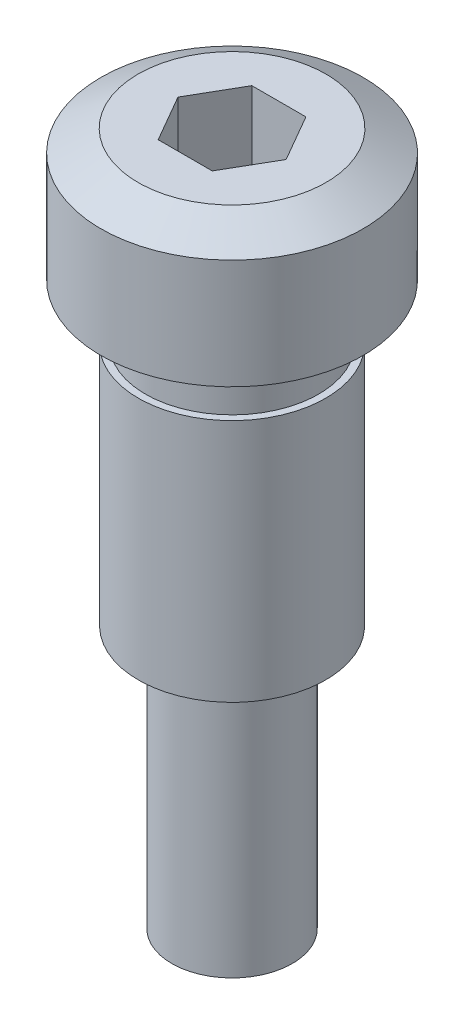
ISO-10303-21;
HEADER;
FILE_DESCRIPTION(('STEP AP214'),'2;1');
FILE_NAME('part.step','',(''),(''),'','','');
FILE_SCHEMA(('AUTOMOTIVE_DESIGN { 1 0 10303 214 1 1 1 1 }'));
ENDSEC;
DATA;
#1=APPLICATION_CONTEXT('core data for automotive mechanical design processes');
#2=APPLICATION_PROTOCOL_DEFINITION('international standard','automotive_design',2000,#1);
#3=PRODUCT_CONTEXT('',#1,'mechanical');
#4=PRODUCT('Part','Part','',(#3));
#5=PRODUCT_RELATED_PRODUCT_CATEGORY('part','',(#4));
#6=PRODUCT_DEFINITION_FORMATION('','',#4);
#7=PRODUCT_DEFINITION_CONTEXT('part definition',#1,'design');
#8=PRODUCT_DEFINITION('design','',#6,#7);
#9=PRODUCT_DEFINITION_SHAPE('','',#8);
#10=(LENGTH_UNIT() NAMED_UNIT(*) SI_UNIT(.MILLI.,.METRE.));
#11=(NAMED_UNIT(*) PLANE_ANGLE_UNIT() SI_UNIT($,.RADIAN.));
#12=(NAMED_UNIT(*) SI_UNIT($,.STERADIAN.) SOLID_ANGLE_UNIT());
#13=UNCERTAINTY_MEASURE_WITH_UNIT(LENGTH_MEASURE(1.E-05),#10,'distance_accuracy_value','');
#14=(GEOMETRIC_REPRESENTATION_CONTEXT(3) GLOBAL_UNCERTAINTY_ASSIGNED_CONTEXT((#13)) GLOBAL_UNIT_ASSIGNED_CONTEXT((#10,
#11,#12)) REPRESENTATION_CONTEXT('',''));
#15=CARTESIAN_POINT('',(0.,0.,0.));
#16=DIRECTION('',(0.,0.,1.));
#17=DIRECTION('',(1.,0.,0.));
#18=AXIS2_PLACEMENT_3D('',#15,#16,#17);
#19=CARTESIAN_POINT('',(0.,5.55752,0.));
#20=DIRECTION('',(0.,1.,0.));
#21=DIRECTION('',(-1.,0.,0.));
#22=AXIS2_PLACEMENT_3D('',#19,#20,#21);
#23=PLANE('',#22);
#24=CARTESIAN_POINT('',(0.,5.55752,0.));
#25=DIRECTION('',(0.,1.,0.));
#26=DIRECTION('',(-1.,0.,0.));
#27=AXIS2_PLACEMENT_3D('',#24,#25,#26);
#28=CIRCLE('',#27,3.98126155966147);
#29=CARTESIAN_POINT('',(-3.98126155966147,5.55752,0.));
#30=VERTEX_POINT('',#29);
#31=EDGE_CURVE('E175',#30,#30,#28,.T.);
#32=ORIENTED_EDGE('',*,*,#31,.T.);
#33=EDGE_LOOP('',(#32));
#34=FACE_BOUND('',#33,.T.);
#35=DIRECTION('',(-0.500000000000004,0.,-0.866025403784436));
#36=VECTOR('',#35,1.);
#37=CARTESIAN_POINT('',(2.29062564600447,5.55752,0.));
#38=LINE('',#37,#36);
#39=CARTESIAN_POINT('',(2.29062564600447,5.55752,0.));
#40=VERTEX_POINT('',#39);
#41=CARTESIAN_POINT('',(1.14531282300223,5.55752,-1.98374));
#42=VERTEX_POINT('',#41);
#43=EDGE_CURVE('E159',#40,#42,#38,.T.);
#44=ORIENTED_EDGE('',*,*,#43,.F.);
#45=DIRECTION('',(-0.500000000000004,0.,0.866025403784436));
#46=VECTOR('',#45,1.);
#47=CARTESIAN_POINT('',(2.29062564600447,5.55752,0.));
#48=LINE('',#47,#46);
#49=CARTESIAN_POINT('',(1.14531282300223,5.55752,1.98374));
#50=VERTEX_POINT('',#49);
#51=EDGE_CURVE('E61',#40,#50,#48,.T.);
#52=ORIENTED_EDGE('',*,*,#51,.T.);
#53=DIRECTION('',(-1.,0.,0.));
#54=VECTOR('',#53,1.);
#55=CARTESIAN_POINT('',(1.14531282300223,5.55752,1.98374));
#56=LINE('',#55,#54);
#57=CARTESIAN_POINT('',(-1.14531282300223,5.55752,1.98374));
#58=VERTEX_POINT('',#57);
#59=EDGE_CURVE('E146',#50,#58,#56,.T.);
#60=ORIENTED_EDGE('',*,*,#59,.T.);
#61=DIRECTION('',(-0.500000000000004,0.,-0.866025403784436));
#62=VECTOR('',#61,1.);
#63=CARTESIAN_POINT('',(-1.14531282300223,5.55752,1.98374));
#64=LINE('',#63,#62);
#65=CARTESIAN_POINT('',(-2.29062564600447,5.55752,0.));
#66=VERTEX_POINT('',#65);
#67=EDGE_CURVE('E150',#58,#66,#64,.T.);
#68=ORIENTED_EDGE('',*,*,#67,.T.);
#69=DIRECTION('',(-0.500000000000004,0.,0.866025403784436));
#70=VECTOR('',#69,1.);
#71=CARTESIAN_POINT('',(-1.14531282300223,5.55752,-1.98374));
#72=LINE('',#71,#70);
#73=CARTESIAN_POINT('',(-1.14531282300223,5.55752,-1.98374));
#74=VERTEX_POINT('',#73);
#75=EDGE_CURVE('E154',#74,#66,#72,.T.);
#76=ORIENTED_EDGE('',*,*,#75,.F.);
#77=DIRECTION('',(-1.,0.,0.));
#78=VECTOR('',#77,1.);
#79=CARTESIAN_POINT('',(1.14531282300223,5.55752,-1.98374));
#80=LINE('',#79,#78);
#81=EDGE_CURVE('E120',#42,#74,#80,.T.);
#82=ORIENTED_EDGE('',*,*,#81,.F.);
#83=EDGE_LOOP('',(#44,#52,#60,#68,#76,#82));
#84=FACE_BOUND('',#83,.T.);
#85=ADVANCED_FACE('F42',(#34,#84),#23,.T.);
#86=CARTESIAN_POINT('',(0.,-23.8125,0.));
#87=DIRECTION('',(0.,1.,0.));
#88=DIRECTION('',(-1.,0.,0.));
#89=AXIS2_PLACEMENT_3D('',#86,#87,#88);
#90=PLANE('',#89);
#91=CARTESIAN_POINT('',(0.,-23.8125,0.));
#92=DIRECTION('',(0.,1.,0.));
#93=DIRECTION('',(-1.,0.,0.));
#94=AXIS2_PLACEMENT_3D('',#91,#92,#93);
#95=CIRCLE('',#94,2.5527);
#96=CARTESIAN_POINT('',(-2.5527,-23.8125,0.));
#97=VERTEX_POINT('',#96);
#98=EDGE_CURVE('E11',#97,#97,#95,.T.);
#99=ORIENTED_EDGE('',*,*,#98,.F.);
#100=EDGE_LOOP('',(#99));
#101=FACE_BOUND('',#100,.T.);
#102=ADVANCED_FACE('F44',(#101),#90,.F.);
#103=CARTESIAN_POINT('',(0.,5.55752,0.));
#104=DIRECTION('',(0.,1.,0.));
#105=DIRECTION('',(-1.,0.,0.));
#106=AXIS2_PLACEMENT_3D('',#103,#104,#105);
#107=CYLINDRICAL_SURFACE('',#106,2.5527);
#108=ORIENTED_EDGE('',*,*,#98,.T.);
#109=EDGE_LOOP('',(#108));
#110=FACE_BOUND('',#109,.T.);
#111=CARTESIAN_POINT('',(0.,-12.7,0.));
#112=DIRECTION('',(0.,1.,0.));
#113=DIRECTION('',(-1.,0.,0.));
#114=AXIS2_PLACEMENT_3D('',#111,#112,#113);
#115=CIRCLE('',#114,2.5527);
#116=CARTESIAN_POINT('',(-2.5527,-12.7,0.));
#117=VERTEX_POINT('',#116);
#118=EDGE_CURVE('E51',#117,#117,#115,.T.);
#119=ORIENTED_EDGE('',*,*,#118,.F.);
#120=EDGE_LOOP('',(#119));
#121=FACE_BOUND('',#120,.T.);
#122=ADVANCED_FACE('F209',(#110,#121),#107,.T.);
#123=CARTESIAN_POINT('',(3.96875,-12.7,0.));
#124=DIRECTION('',(0.,-1.,0.));
#125=DIRECTION('',(1.,0.,0.));
#126=AXIS2_PLACEMENT_3D('',#123,#124,#125);
#127=PLANE('',#126);
#128=ORIENTED_EDGE('',*,*,#118,.T.);
#129=EDGE_LOOP('',(#128));
#130=FACE_BOUND('',#129,.T.);
#131=CARTESIAN_POINT('',(0.,-12.7,0.));
#132=DIRECTION('',(0.,1.,0.));
#133=DIRECTION('',(-1.,0.,0.));
#134=AXIS2_PLACEMENT_3D('',#131,#132,#133);
#135=CIRCLE('',#134,3.96875);
#136=CARTESIAN_POINT('',(-3.96875,-12.7,0.));
#137=VERTEX_POINT('',#136);
#138=EDGE_CURVE('E199',#137,#137,#135,.T.);
#139=ORIENTED_EDGE('',*,*,#138,.F.);
#140=EDGE_LOOP('',(#139));
#141=FACE_BOUND('',#140,.T.);
#142=ADVANCED_FACE('F206',(#130,#141),#127,.T.);
#143=CARTESIAN_POINT('',(0.,5.55752,0.));
#144=DIRECTION('',(0.,1.,0.));
#145=DIRECTION('',(-1.,0.,0.));
#146=AXIS2_PLACEMENT_3D('',#143,#144,#145);
#147=CYLINDRICAL_SURFACE('',#146,3.96875);
#148=ORIENTED_EDGE('',*,*,#138,.T.);
#149=EDGE_LOOP('',(#148));
#150=FACE_BOUND('',#149,.T.);
#151=CARTESIAN_POINT('',(0.,-2.3622,0.));
#152=DIRECTION('',(0.,1.,0.));
#153=DIRECTION('',(-1.,0.,0.));
#154=AXIS2_PLACEMENT_3D('',#151,#152,#153);
#155=CIRCLE('',#154,3.96875);
#156=CARTESIAN_POINT('',(-3.96875,-2.3622,0.));
#157=VERTEX_POINT('',#156);
#158=EDGE_CURVE('E195',#157,#157,#155,.T.);
#159=ORIENTED_EDGE('',*,*,#158,.F.);
#160=EDGE_LOOP('',(#159));
#161=FACE_BOUND('',#160,.T.);
#162=ADVANCED_FACE('F216',(#150,#161),#147,.T.);
#163=CARTESIAN_POINT('',(3.6703,-2.3622,0.));
#164=DIRECTION('',(0.,1.,0.));
#165=DIRECTION('',(-1.,0.,0.));
#166=AXIS2_PLACEMENT_3D('',#163,#164,#165);
#167=PLANE('',#166);
#168=ORIENTED_EDGE('',*,*,#158,.T.);
#169=EDGE_LOOP('',(#168));
#170=FACE_BOUND('',#169,.T.);
#171=CARTESIAN_POINT('',(0.,-2.3622,0.));
#172=DIRECTION('',(0.,1.,0.));
#173=DIRECTION('',(-1.,0.,0.));
#174=AXIS2_PLACEMENT_3D('',#171,#172,#173);
#175=CIRCLE('',#174,3.6703);
#176=CARTESIAN_POINT('',(-3.6703,-2.3622,0.));
#177=VERTEX_POINT('',#176);
#178=EDGE_CURVE('E191',#177,#177,#175,.T.);
#179=ORIENTED_EDGE('',*,*,#178,.F.);
#180=EDGE_LOOP('',(#179));
#181=FACE_BOUND('',#180,.T.);
#182=ADVANCED_FACE('F244',(#170,#181),#167,.T.);
#183=CARTESIAN_POINT('',(0.,5.55752,0.));
#184=DIRECTION('',(0.,1.,0.));
#185=DIRECTION('',(-1.,0.,0.));
#186=AXIS2_PLACEMENT_3D('',#183,#184,#185);
#187=CYLINDRICAL_SURFACE('',#186,3.6703);
#188=ORIENTED_EDGE('',*,*,#178,.T.);
#189=EDGE_LOOP('',(#188));
#190=FACE_BOUND('',#189,.T.);
#191=CARTESIAN_POINT('',(0.,0.,0.));
#192=DIRECTION('',(0.,1.,0.));
#193=DIRECTION('',(-1.,0.,0.));
#194=AXIS2_PLACEMENT_3D('',#191,#192,#193);
#195=CIRCLE('',#194,3.6703);
#196=CARTESIAN_POINT('',(-3.6703,0.,0.));
#197=VERTEX_POINT('',#196);
#198=EDGE_CURVE('E187',#197,#197,#195,.T.);
#199=ORIENTED_EDGE('',*,*,#198,.F.);
#200=EDGE_LOOP('',(#199));
#201=FACE_BOUND('',#200,.T.);
#202=ADVANCED_FACE('F240',(#190,#201),#187,.T.);
#203=CARTESIAN_POINT('',(3.6703,0.,0.));
#204=DIRECTION('',(0.,1.,0.));
#205=DIRECTION('',(-1.,0.,0.));
#206=AXIS2_PLACEMENT_3D('',#203,#204,#205);
#207=PLANE('',#206);
#208=CARTESIAN_POINT('',(0.,0.,0.));
#209=DIRECTION('',(0.,1.,0.));
#210=DIRECTION('',(-1.,0.,0.));
#211=AXIS2_PLACEMENT_3D('',#208,#209,#210);
#212=CIRCLE('',#211,5.55625);
#213=CARTESIAN_POINT('',(-5.55625,0.,0.));
#214=VERTEX_POINT('',#213);
#215=EDGE_CURVE('E183',#214,#214,#212,.T.);
#216=ORIENTED_EDGE('',*,*,#215,.F.);
#217=EDGE_LOOP('',(#216));
#218=FACE_BOUND('',#217,.T.);
#219=ORIENTED_EDGE('',*,*,#198,.T.);
#220=EDGE_LOOP('',(#219));
#221=FACE_BOUND('',#220,.T.);
#222=ADVANCED_FACE('F236',(#218,#221),#207,.F.);
#223=CARTESIAN_POINT('',(0.,5.55752,0.));
#224=DIRECTION('',(0.,1.,0.));
#225=DIRECTION('',(-1.,0.,0.));
#226=AXIS2_PLACEMENT_3D('',#223,#224,#225);
#227=CYLINDRICAL_SURFACE('',#226,5.55625);
#228=ORIENTED_EDGE('',*,*,#215,.T.);
#229=EDGE_LOOP('',(#228));
#230=FACE_BOUND('',#229,.T.);
#231=CARTESIAN_POINT('',(0.,4.6482,0.));
#232=DIRECTION('',(0.,1.,0.));
#233=DIRECTION('',(-1.,0.,0.));
#234=AXIS2_PLACEMENT_3D('',#231,#232,#233);
#235=CIRCLE('',#234,5.55625);
#236=CARTESIAN_POINT('',(-5.55625,4.6482,0.));
#237=VERTEX_POINT('',#236);
#238=EDGE_CURVE('E179',#237,#237,#235,.T.);
#239=ORIENTED_EDGE('',*,*,#238,.F.);
#240=EDGE_LOOP('',(#239));
#241=FACE_BOUND('',#240,.T.);
#242=ADVANCED_FACE('F232',(#230,#241),#227,.T.);
#243=CARTESIAN_POINT('',(0.,5.55752,0.));
#244=DIRECTION('',(0.,-1.,0.));
#245=DIRECTION('',(1.,0.,0.));
#246=AXIS2_PLACEMENT_3D('',#243,#244,#245);
#247=CONICAL_SURFACE('',#246,3.98126155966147,1.0471975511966);
#248=ORIENTED_EDGE('',*,*,#238,.T.);
#249=EDGE_LOOP('',(#248));
#250=FACE_BOUND('',#249,.T.);
#251=ORIENTED_EDGE('',*,*,#31,.F.);
#252=EDGE_LOOP('',(#251));
#253=FACE_BOUND('',#252,.T.);
#254=ADVANCED_FACE('F229',(#250,#253),#247,.T.);
#255=CARTESIAN_POINT('',(2.29062564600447,2.58572,0.));
#256=DIRECTION('',(-0.866025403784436,0.,-0.500000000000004));
#257=DIRECTION('',(-0.500000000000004,0.,0.866025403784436));
#258=AXIS2_PLACEMENT_3D('',#255,#256,#257);
#259=PLANE('',#258);
#260=ORIENTED_EDGE('',*,*,#51,.F.);
#261=DIRECTION('',(0.,1.,0.));
#262=VECTOR('',#261,1.);
#263=CARTESIAN_POINT('',(2.29062564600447,2.58572,0.));
#264=LINE('',#263,#262);
#265=CARTESIAN_POINT('',(2.29062564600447,2.58572,0.));
#266=VERTEX_POINT('',#265);
#267=EDGE_CURVE('E68',#266,#40,#264,.T.);
#268=ORIENTED_EDGE('',*,*,#267,.F.);
#269=DIRECTION('',(-0.500000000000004,0.,0.866025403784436));
#270=VECTOR('',#269,1.);
#271=CARTESIAN_POINT('',(2.29062564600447,2.58572,0.));
#272=LINE('',#271,#270);
#273=CARTESIAN_POINT('',(1.14531282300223,2.58572,1.98374));
#274=VERTEX_POINT('',#273);
#275=EDGE_CURVE('E162',#266,#274,#272,.T.);
#276=ORIENTED_EDGE('',*,*,#275,.T.);
#277=DIRECTION('',(0.,1.,0.));
#278=VECTOR('',#277,1.);
#279=CARTESIAN_POINT('',(1.14531282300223,2.58572,1.98374));
#280=LINE('',#279,#278);
#281=EDGE_CURVE('E172',#274,#50,#280,.T.);
#282=ORIENTED_EDGE('',*,*,#281,.T.);
#283=EDGE_LOOP('',(#260,#268,#276,#282));
#284=FACE_BOUND('',#283,.T.);
#285=ADVANCED_FACE('F227',(#284),#259,.T.);
#286=CARTESIAN_POINT('',(1.14531282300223,2.58572,1.98374));
#287=DIRECTION('',(0.,0.,-1.));
#288=DIRECTION('',(-1.,0.,0.));
#289=AXIS2_PLACEMENT_3D('',#286,#287,#288);
#290=PLANE('',#289);
#291=ORIENTED_EDGE('',*,*,#59,.F.);
#292=ORIENTED_EDGE('',*,*,#281,.F.);
#293=DIRECTION('',(-1.,0.,0.));
#294=VECTOR('',#293,1.);
#295=CARTESIAN_POINT('',(1.14531282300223,2.58572,1.98374));
#296=LINE('',#295,#294);
#297=CARTESIAN_POINT('',(-1.14531282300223,2.58572,1.98374));
#298=VERTEX_POINT('',#297);
#299=EDGE_CURVE('E104',#274,#298,#296,.T.);
#300=ORIENTED_EDGE('',*,*,#299,.T.);
#301=DIRECTION('',(0.,1.,0.));
#302=VECTOR('',#301,1.);
#303=CARTESIAN_POINT('',(-1.14531282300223,2.58572,1.98374));
#304=LINE('',#303,#302);
#305=EDGE_CURVE('E169',#298,#58,#304,.T.);
#306=ORIENTED_EDGE('',*,*,#305,.T.);
#307=EDGE_LOOP('',(#291,#292,#300,#306));
#308=FACE_BOUND('',#307,.T.);
#309=ADVANCED_FACE('F289',(#308),#290,.T.);
#310=CARTESIAN_POINT('',(-1.14531282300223,2.58572,1.98374));
#311=DIRECTION('',(0.866025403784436,0.,-0.500000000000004));
#312=DIRECTION('',(-0.500000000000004,0.,-0.866025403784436));
#313=AXIS2_PLACEMENT_3D('',#310,#311,#312);
#314=PLANE('',#313);
#315=ORIENTED_EDGE('',*,*,#67,.F.);
#316=ORIENTED_EDGE('',*,*,#305,.F.);
#317=DIRECTION('',(-0.500000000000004,0.,-0.866025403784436));
#318=VECTOR('',#317,1.);
#319=CARTESIAN_POINT('',(-1.14531282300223,2.58572,1.98374));
#320=LINE('',#319,#318);
#321=CARTESIAN_POINT('',(-2.29062564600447,2.58572,0.));
#322=VERTEX_POINT('',#321);
#323=EDGE_CURVE('E132',#298,#322,#320,.T.);
#324=ORIENTED_EDGE('',*,*,#323,.T.);
#325=DIRECTION('',(0.,1.,0.));
#326=VECTOR('',#325,1.);
#327=CARTESIAN_POINT('',(-2.29062564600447,2.58572,0.));
#328=LINE('',#327,#326);
#329=EDGE_CURVE('E125',#322,#66,#328,.T.);
#330=ORIENTED_EDGE('',*,*,#329,.T.);
#331=EDGE_LOOP('',(#315,#316,#324,#330));
#332=FACE_BOUND('',#331,.T.);
#333=ADVANCED_FACE('F295',(#332),#314,.T.);
#334=CARTESIAN_POINT('',(-1.14531282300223,2.58572,-1.98374));
#335=DIRECTION('',(-0.866025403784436,0.,-0.500000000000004));
#336=DIRECTION('',(-0.500000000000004,0.,0.866025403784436));
#337=AXIS2_PLACEMENT_3D('',#334,#335,#336);
#338=PLANE('',#337);
#339=ORIENTED_EDGE('',*,*,#75,.T.);
#340=ORIENTED_EDGE('',*,*,#329,.F.);
#341=DIRECTION('',(-0.500000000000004,0.,0.866025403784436));
#342=VECTOR('',#341,1.);
#343=CARTESIAN_POINT('',(-1.14531282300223,2.58572,-1.98374));
#344=LINE('',#343,#342);
#345=CARTESIAN_POINT('',(-1.14531282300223,2.58572,-1.98374));
#346=VERTEX_POINT('',#345);
#347=EDGE_CURVE('E129',#346,#322,#344,.T.);
#348=ORIENTED_EDGE('',*,*,#347,.F.);
#349=DIRECTION('',(0.,1.,0.));
#350=VECTOR('',#349,1.);
#351=CARTESIAN_POINT('',(-1.14531282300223,2.58572,-1.98374));
#352=LINE('',#351,#350);
#353=EDGE_CURVE('E113',#346,#74,#352,.T.);
#354=ORIENTED_EDGE('',*,*,#353,.T.);
#355=EDGE_LOOP('',(#339,#340,#348,#354));
#356=FACE_BOUND('',#355,.T.);
#357=ADVANCED_FACE('F130',(#356),#338,.F.);
#358=CARTESIAN_POINT('',(1.14531282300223,2.58572,-1.98374));
#359=DIRECTION('',(0.,0.,-1.));
#360=DIRECTION('',(-1.,0.,0.));
#361=AXIS2_PLACEMENT_3D('',#358,#359,#360);
#362=PLANE('',#361);
#363=ORIENTED_EDGE('',*,*,#81,.T.);
#364=ORIENTED_EDGE('',*,*,#353,.F.);
#365=DIRECTION('',(-1.,0.,0.));
#366=VECTOR('',#365,1.);
#367=CARTESIAN_POINT('',(1.14531282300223,2.58572,-1.98374));
#368=LINE('',#367,#366);
#369=CARTESIAN_POINT('',(1.14531282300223,2.58572,-1.98374));
#370=VERTEX_POINT('',#369);
#371=EDGE_CURVE('E117',#370,#346,#368,.T.);
#372=ORIENTED_EDGE('',*,*,#371,.F.);
#373=DIRECTION('',(0.,1.,0.));
#374=VECTOR('',#373,1.);
#375=CARTESIAN_POINT('',(1.14531282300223,2.58572,-1.98374));
#376=LINE('',#375,#374);
#377=EDGE_CURVE('E96',#370,#42,#376,.T.);
#378=ORIENTED_EDGE('',*,*,#377,.T.);
#379=EDGE_LOOP('',(#363,#364,#372,#378));
#380=FACE_BOUND('',#379,.T.);
#381=ADVANCED_FACE('F115',(#380),#362,.F.);
#382=CARTESIAN_POINT('',(2.29062564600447,2.58572,0.));
#383=DIRECTION('',(0.866025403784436,0.,-0.500000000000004));
#384=DIRECTION('',(-0.500000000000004,0.,-0.866025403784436));
#385=AXIS2_PLACEMENT_3D('',#382,#383,#384);
#386=PLANE('',#385);
#387=ORIENTED_EDGE('',*,*,#43,.T.);
#388=ORIENTED_EDGE('',*,*,#377,.F.);
#389=DIRECTION('',(-0.500000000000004,0.,-0.866025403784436));
#390=VECTOR('',#389,1.);
#391=CARTESIAN_POINT('',(2.29062564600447,2.58572,0.));
#392=LINE('',#391,#390);
#393=EDGE_CURVE('E136',#266,#370,#392,.T.);
#394=ORIENTED_EDGE('',*,*,#393,.F.);
#395=ORIENTED_EDGE('',*,*,#267,.T.);
#396=EDGE_LOOP('',(#387,#388,#394,#395));
#397=FACE_BOUND('',#396,.T.);
#398=ADVANCED_FACE('F313',(#397),#386,.F.);
#399=CARTESIAN_POINT('',(0.,2.58572,3.96747999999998));
#400=DIRECTION('',(0.,-1.,0.));
#401=DIRECTION('',(0.,0.,-1.));
#402=AXIS2_PLACEMENT_3D('',#399,#400,#401);
#403=PLANE('',#402);
#404=ORIENTED_EDGE('',*,*,#275,.F.);
#405=ORIENTED_EDGE('',*,*,#393,.T.);
#406=ORIENTED_EDGE('',*,*,#371,.T.);
#407=ORIENTED_EDGE('',*,*,#347,.T.);
#408=ORIENTED_EDGE('',*,*,#323,.F.);
#409=ORIENTED_EDGE('',*,*,#299,.F.);
#410=EDGE_LOOP('',(#404,#405,#406,#407,#408,#409));
#411=FACE_BOUND('',#410,.T.);
#412=ADVANCED_FACE('F134',(#411),#403,.F.);
#413=CLOSED_SHELL('',(#85,#102,#122,#142,#162,#182,#202,#222,#242,#254,#285,#309,#333,#357,#381,
#398,#412));
#414=MANIFOLD_SOLID_BREP('B2',#413);
#415=ADVANCED_BREP_SHAPE_REPRESENTATION('',(#18,#414),#14);
#416=SHAPE_DEFINITION_REPRESENTATION(#9,#415);
ENDSEC;
END-ISO-10303-21;
